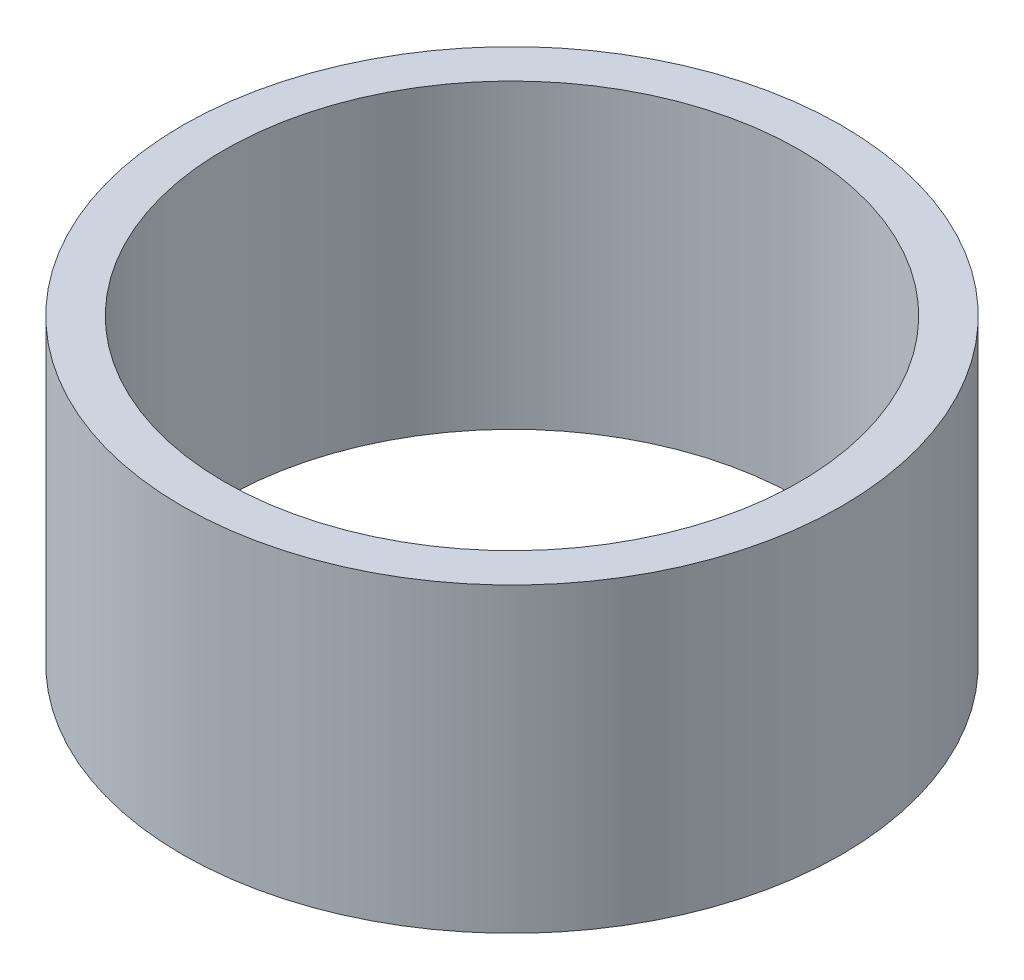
from build123d import *

# Parameters (mm, degrees)
ESQUISSE1_W = 3
ESQUISSE1_H = 21.5


with BuildPart() as part:
    # Esquisse1 → R_volution1 (revolve)
    with BuildSketch(Plane.XY, mode=Mode.PRIVATE) as r_volution1_sk:
        with Locations((22, 10.75)):
            Rectangle(ESQUISSE1_W, ESQUISSE1_H)
    revolve(r_volution1_sk.sketch.rotate(Axis((0, 28.120065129, 0), (0, -1, 0)), 90), axis=Axis((0, 28.120065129, 0), (0, -1, 0)))


solid = part.part
